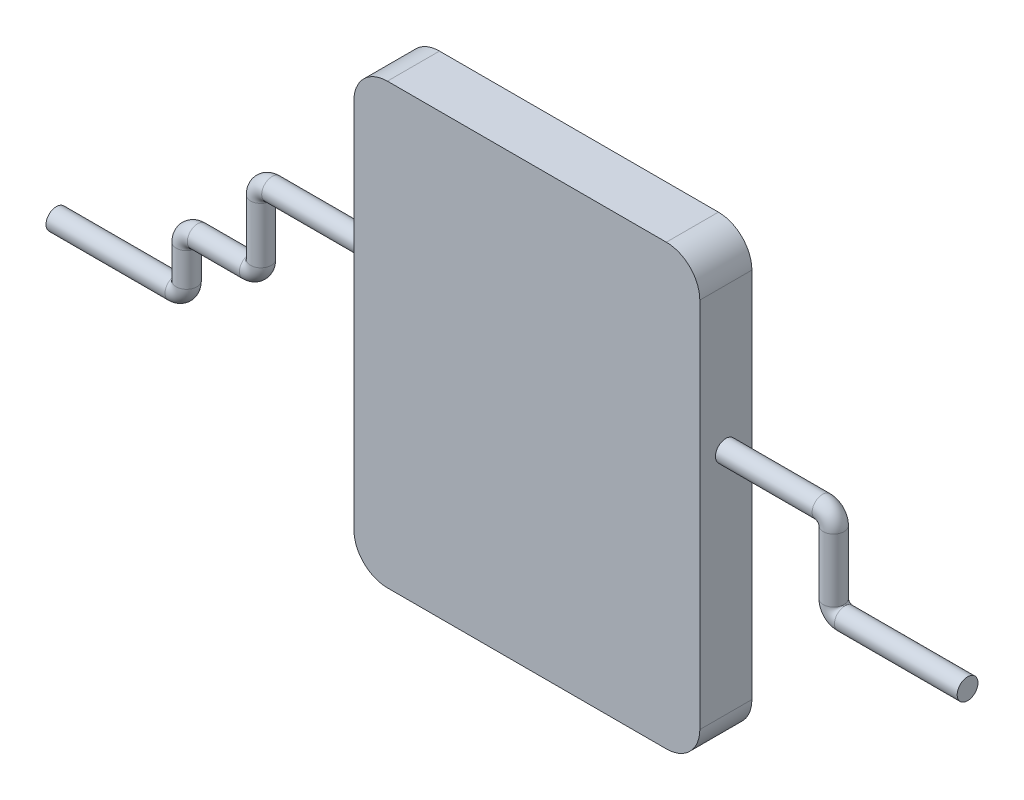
from build123d import *

# Parameters (mm, degrees)
SKETCH1_W           = 23.622
SKETCH1_H           = 29.972
BOSS_EXTRUDE1_DEPTH = 1.778
FILLET1_R           = 2.286
SKETCH3_R           = 0.7112
SKETCH6_R           = 0.7112


with BuildPart() as part:
    # Sketch1 → Boss-Extrude1 (new, symmetric)
    with BuildSketch(Plane.XY):
        Rectangle(SKETCH1_W, SKETCH1_H)
    extrude(amount=BOSS_EXTRUDE1_DEPTH, both=True)

    # Fillet1
    fillet1_edges = [part.edges().sort_by_distance(p)[0] for p in [
        (11.811, -14.986, 0),
        (-11.811, -14.986, 0),
        (-11.811, 14.986, 0),
        (11.811, 14.986, 0),
    ]]
    fillet(fillet1_edges, radius=FILLET1_R)

    # Sweep1: sweep along a path in Sketch2
    with BuildLine(Plane.XY) as sweep1_path:
        Line((11.811, 2.921), (18.415, 2.921))
        ThreePointArc((18.415, 2.921), (18.953815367, 2.697815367), (19.177, 2.159))
        Line((19.177, 2.159), (19.177, -2.159))
        ThreePointArc((19.177, -2.159), (19.400184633, -2.697815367), (19.939, -2.921))
        Line((19.939, -2.921), (28.321, -2.921))
    # Sketch3 → Sweep1 (sweep)
    with BuildSketch(Plane(origin=(11.811, 0, 0), x_dir=(0, 0, -1), z_dir=(1, 0, 0))):
        with Locations((0, 2.921)):
            Circle(SKETCH3_R)
    sweep(path=sweep1_path.line)

    # Sweep2: sweep along a path in Sketch4
    with BuildLine(Plane.XY) as sweep2_path:
        Line((-11.811, 2.921), (-19.177, 2.921))
        ThreePointArc((-19.177, 2.921), (-19.715815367, 2.697815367), (-19.939, 2.159))
        Line((-19.939, 2.159), (-19.939, -1.651))
        ThreePointArc((-19.939, -1.651), (-20.162184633, -2.189815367), (-20.701, -2.413))
        Line((-20.701, -2.413), (-24.257, -2.413))
        ThreePointArc((-24.257, -2.413), (-24.795815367, -2.636184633), (-25.019, -3.175))
        Line((-25.019, -3.175), (-25.019, -5.461))
        ThreePointArc((-25.019, -5.461), (-25.242184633, -5.999815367), (-25.781, -6.223))
        Line((-25.781, -6.223), (-33.909, -6.223))
    # Sketch6 → Sweep2 (sweep)
    with BuildSketch(Plane.ZY.offset(11.811)):
        with Locations((0, 2.921)):
            Circle(SKETCH6_R)
    sweep(path=sweep2_path.line)


solid = part.part
